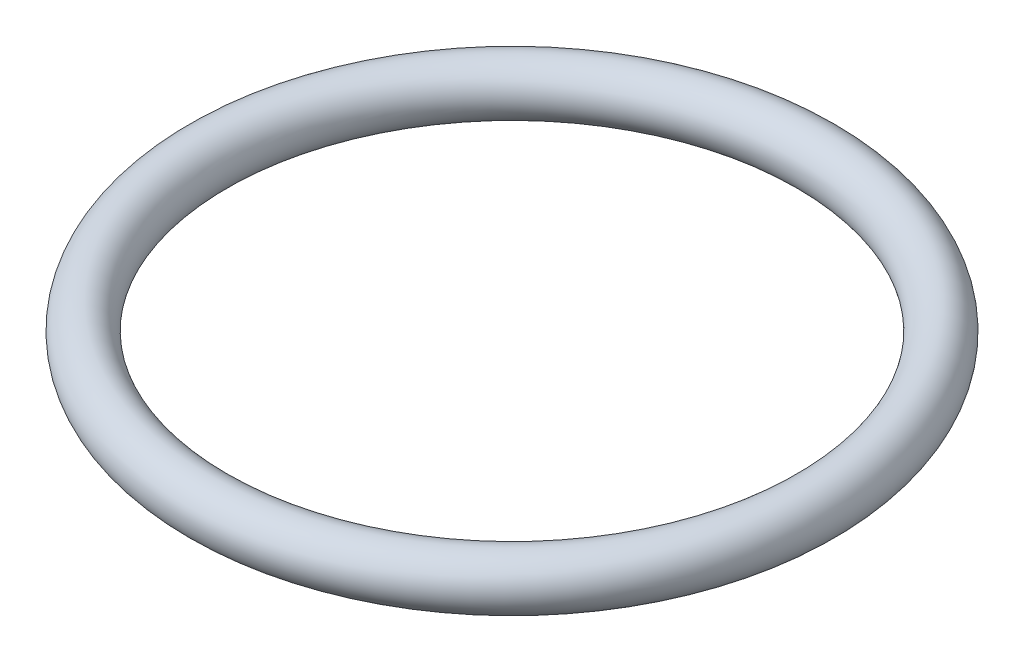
from build123d import *

# Parameters (mm, degrees)
SKETCH1_R = 0.889


with BuildPart() as part:
    # Sketch1 → Revolve1 (revolve)
    with BuildSketch(Plane.XY, mode=Mode.PRIVATE) as revolve1_sk:
        with Locations((10.2743, 0)):
            Circle(SKETCH1_R)
    revolve(revolve1_sk.sketch.rotate(Axis((0, 0, 0), (0, 1, 0)), 90), axis=Axis((0, 0, 0), (0, 1, 0)))


solid = part.part
